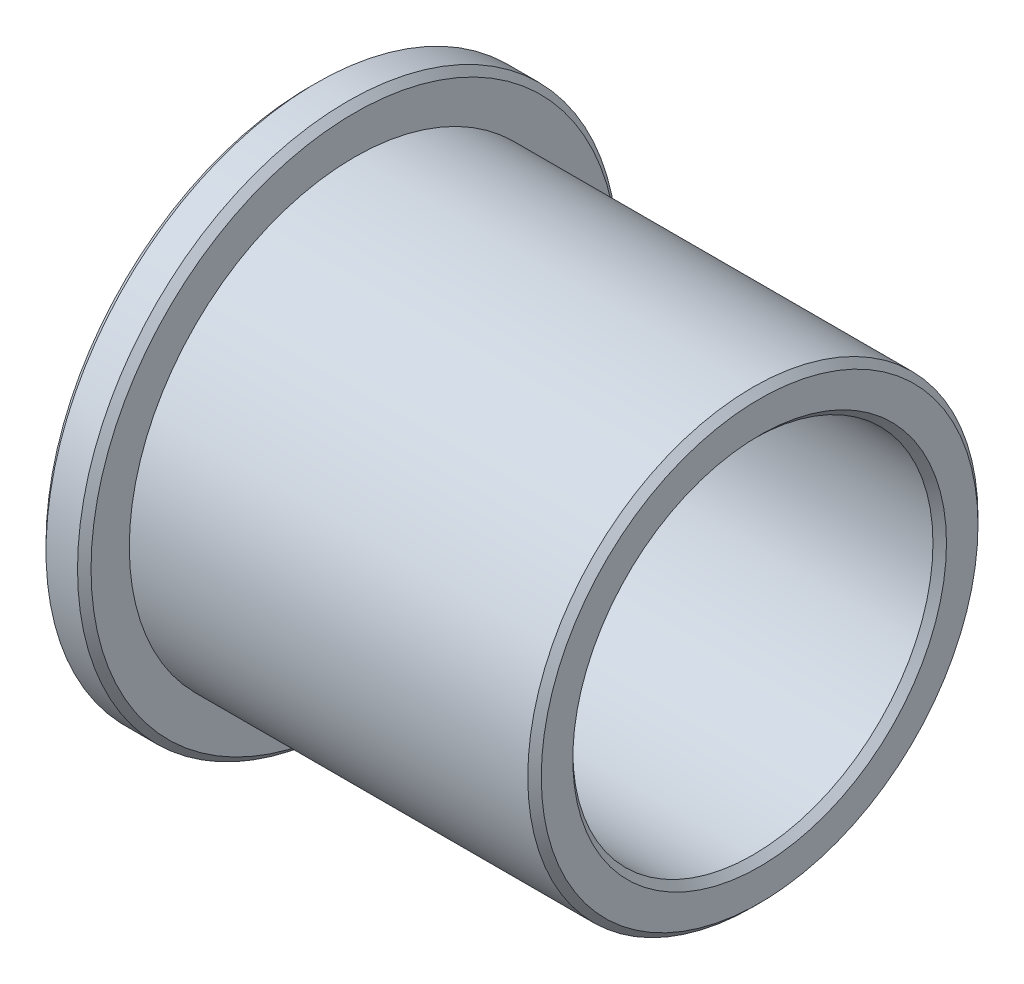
ISO-10303-21;
HEADER;
FILE_DESCRIPTION(('STEP AP214'),'2;1');
FILE_NAME('part.step','',(''),(''),'','','');
FILE_SCHEMA(('AUTOMOTIVE_DESIGN { 1 0 10303 214 1 1 1 1 }'));
ENDSEC;
DATA;
#1=APPLICATION_CONTEXT('core data for automotive mechanical design processes');
#2=APPLICATION_PROTOCOL_DEFINITION('international standard','automotive_design',2000,#1);
#3=PRODUCT_CONTEXT('',#1,'mechanical');
#4=PRODUCT('Part','Part','',(#3));
#5=PRODUCT_RELATED_PRODUCT_CATEGORY('part','',(#4));
#6=PRODUCT_DEFINITION_FORMATION('','',#4);
#7=PRODUCT_DEFINITION_CONTEXT('part definition',#1,'design');
#8=PRODUCT_DEFINITION('design','',#6,#7);
#9=PRODUCT_DEFINITION_SHAPE('','',#8);
#10=(LENGTH_UNIT() NAMED_UNIT(*) SI_UNIT(.MILLI.,.METRE.));
#11=(NAMED_UNIT(*) PLANE_ANGLE_UNIT() SI_UNIT($,.RADIAN.));
#12=(NAMED_UNIT(*) SI_UNIT($,.STERADIAN.) SOLID_ANGLE_UNIT());
#13=UNCERTAINTY_MEASURE_WITH_UNIT(LENGTH_MEASURE(1.E-05),#10,'distance_accuracy_value','');
#14=(GEOMETRIC_REPRESENTATION_CONTEXT(3) GLOBAL_UNCERTAINTY_ASSIGNED_CONTEXT((#13)) GLOBAL_UNIT_ASSIGNED_CONTEXT((#10,
#11,#12)) REPRESENTATION_CONTEXT('',''));
#15=CARTESIAN_POINT('',(0.,0.,0.));
#16=DIRECTION('',(0.,0.,1.));
#17=DIRECTION('',(1.,0.,0.));
#18=AXIS2_PLACEMENT_3D('',#15,#16,#17);
#19=CARTESIAN_POINT('',(-1.34618228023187E-10,0.,0.));
#20=DIRECTION('',(-1.,0.,0.));
#21=DIRECTION('',(0.,0.,1.));
#22=AXIS2_PLACEMENT_3D('',#19,#20,#21);
#23=CONICAL_SURFACE('',#22,8.29999999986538,0.785398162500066);
#24=CARTESIAN_POINT('',(0.3,0.,0.));
#25=DIRECTION('',(1.,0.,0.));
#26=DIRECTION('',(0.,0.,-1.));
#27=AXIS2_PLACEMENT_3D('',#24,#25,#26);
#28=CIRCLE('',#27,7.99999999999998);
#29=CARTESIAN_POINT('',(0.3,0.,-7.99999999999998));
#30=VERTEX_POINT('',#29);
#31=EDGE_CURVE('E45',#30,#30,#28,.T.);
#32=ORIENTED_EDGE('',*,*,#31,.T.);
#33=EDGE_LOOP('',(#32));
#34=FACE_BOUND('',#33,.T.);
#35=CARTESIAN_POINT('',(-1.34617523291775E-10,0.,0.));
#36=DIRECTION('',(-1.,0.,0.));
#37=DIRECTION('',(0.,0.,1.));
#38=AXIS2_PLACEMENT_3D('',#35,#36,#37);
#39=CIRCLE('',#38,8.29999999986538);
#40=CARTESIAN_POINT('',(-1.34617523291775E-10,0.,8.29999999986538));
#41=VERTEX_POINT('',#40);
#42=EDGE_CURVE('E18',#41,#41,#39,.F.);
#43=ORIENTED_EDGE('',*,*,#42,.F.);
#44=EDGE_LOOP('',(#43));
#45=FACE_BOUND('',#44,.T.);
#46=ADVANCED_FACE('F15',(#34,#45),#23,.F.);
#47=CARTESIAN_POINT('',(0.,10.,0.));
#48=DIRECTION('',(-1.,0.,0.));
#49=DIRECTION('',(0.,0.,1.));
#50=AXIS2_PLACEMENT_3D('',#47,#48,#49);
#51=PLANE('',#50);
#52=ORIENTED_EDGE('',*,*,#42,.T.);
#53=EDGE_LOOP('',(#52));
#54=FACE_BOUND('',#53,.T.);
#55=CARTESIAN_POINT('',(-1.34616981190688E-10,0.,0.));
#56=DIRECTION('',(1.,0.,0.));
#57=DIRECTION('',(0.,0.,-1.));
#58=AXIS2_PLACEMENT_3D('',#55,#56,#57);
#59=CIRCLE('',#58,11.7000000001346);
#60=CARTESIAN_POINT('',(-1.34616981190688E-10,0.,-11.7000000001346));
#61=VERTEX_POINT('',#60);
#62=EDGE_CURVE('E42',#61,#61,#59,.T.);
#63=ORIENTED_EDGE('',*,*,#62,.F.);
#64=EDGE_LOOP('',(#63));
#65=FACE_BOUND('',#64,.T.);
#66=ADVANCED_FACE('F144',(#54,#65),#51,.T.);
#67=CARTESIAN_POINT('',(10.,0.,0.));
#68=DIRECTION('',(1.,0.,0.));
#69=DIRECTION('',(0.,0.,-1.));
#70=AXIS2_PLACEMENT_3D('',#67,#68,#69);
#71=CYLINDRICAL_SURFACE('',#70,7.99999999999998);
#72=CARTESIAN_POINT('',(19.6999999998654,0.,0.));
#73=DIRECTION('',(1.,0.,0.));
#74=DIRECTION('',(0.,1.,0.));
#75=AXIS2_PLACEMENT_3D('',#72,#73,#74);
#76=CIRCLE('',#75,8.00000000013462);
#77=CARTESIAN_POINT('',(19.6999999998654,8.00000000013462,0.));
#78=VERTEX_POINT('',#77);
#79=EDGE_CURVE('E44',#78,#78,#76,.T.);
#80=ORIENTED_EDGE('',*,*,#79,.T.);
#81=EDGE_LOOP('',(#80));
#82=FACE_BOUND('',#81,.T.);
#83=ORIENTED_EDGE('',*,*,#31,.F.);
#84=EDGE_LOOP('',(#83));
#85=FACE_BOUND('',#84,.T.);
#86=ADVANCED_FACE('F137',(#82,#85),#71,.F.);
#87=CARTESIAN_POINT('',(0.300000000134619,0.,0.));
#88=DIRECTION('',(1.,0.,0.));
#89=DIRECTION('',(0.,0.,-1.));
#90=AXIS2_PLACEMENT_3D('',#87,#88,#89);
#91=CONICAL_SURFACE('',#90,11.9999999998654,0.7853981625);
#92=ORIENTED_EDGE('',*,*,#62,.T.);
#93=EDGE_LOOP('',(#92));
#94=FACE_BOUND('',#93,.T.);
#95=CARTESIAN_POINT('',(0.3,0.,0.));
#96=DIRECTION('',(1.,0.,0.));
#97=DIRECTION('',(0.,0.,-1.));
#98=AXIS2_PLACEMENT_3D('',#95,#96,#97);
#99=CIRCLE('',#98,12.);
#100=CARTESIAN_POINT('',(0.3,0.,-12.));
#101=VERTEX_POINT('',#100);
#102=EDGE_CURVE('E41',#101,#101,#99,.T.);
#103=ORIENTED_EDGE('',*,*,#102,.F.);
#104=EDGE_LOOP('',(#103));
#105=FACE_BOUND('',#104,.T.);
#106=ADVANCED_FACE('F84',(#94,#105),#91,.T.);
#107=CARTESIAN_POINT('',(20.0000000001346,0.,0.));
#108=DIRECTION('',(1.,0.,0.));
#109=DIRECTION('',(0.,0.,-1.));
#110=AXIS2_PLACEMENT_3D('',#107,#108,#109);
#111=CONICAL_SURFACE('',#110,8.29999999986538,0.785398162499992);
#112=CARTESIAN_POINT('',(20.0000000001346,0.,0.));
#113=DIRECTION('',(1.,0.,0.));
#114=DIRECTION('',(0.,0.,-1.));
#115=AXIS2_PLACEMENT_3D('',#112,#113,#114);
#116=CIRCLE('',#115,8.29999999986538);
#117=CARTESIAN_POINT('',(20.0000000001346,0.,-8.29999999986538));
#118=VERTEX_POINT('',#117);
#119=EDGE_CURVE('E39',#118,#118,#116,.F.);
#120=ORIENTED_EDGE('',*,*,#119,.F.);
#121=EDGE_LOOP('',(#120));
#122=FACE_BOUND('',#121,.T.);
#123=ORIENTED_EDGE('',*,*,#79,.F.);
#124=EDGE_LOOP('',(#123));
#125=FACE_BOUND('',#124,.T.);
#126=ADVANCED_FACE('F74',(#122,#125),#111,.F.);
#127=CARTESIAN_POINT('',(1.,0.,0.));
#128=DIRECTION('',(1.,0.,0.));
#129=DIRECTION('',(0.,0.,-1.));
#130=AXIS2_PLACEMENT_3D('',#127,#128,#129);
#131=CYLINDRICAL_SURFACE('',#130,12.);
#132=ORIENTED_EDGE('',*,*,#102,.T.);
#133=EDGE_LOOP('',(#132));
#134=FACE_BOUND('',#133,.T.);
#135=CARTESIAN_POINT('',(1.69999999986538,0.,0.));
#136=DIRECTION('',(-1.,0.,0.));
#137=DIRECTION('',(0.,1.,0.));
#138=AXIS2_PLACEMENT_3D('',#135,#136,#137);
#139=CIRCLE('',#138,11.9999999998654);
#140=CARTESIAN_POINT('',(1.69999999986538,11.9999999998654,0.));
#141=VERTEX_POINT('',#140);
#142=EDGE_CURVE('E38',#141,#141,#139,.F.);
#143=ORIENTED_EDGE('',*,*,#142,.F.);
#144=EDGE_LOOP('',(#143));
#145=FACE_BOUND('',#144,.T.);
#146=ADVANCED_FACE('F71',(#134,#145),#131,.T.);
#147=CARTESIAN_POINT('',(20.,9.,0.));
#148=DIRECTION('',(1.,0.,0.));
#149=DIRECTION('',(0.,0.,-1.));
#150=AXIS2_PLACEMENT_3D('',#147,#148,#149);
#151=PLANE('',#150);
#152=ORIENTED_EDGE('',*,*,#119,.T.);
#153=EDGE_LOOP('',(#152));
#154=FACE_BOUND('',#153,.T.);
#155=CARTESIAN_POINT('',(20.0000000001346,0.,0.));
#156=DIRECTION('',(-1.,0.,0.));
#157=DIRECTION('',(0.,0.,1.));
#158=AXIS2_PLACEMENT_3D('',#155,#156,#157);
#159=CIRCLE('',#158,9.70000000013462);
#160=CARTESIAN_POINT('',(20.0000000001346,0.,9.70000000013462));
#161=VERTEX_POINT('',#160);
#162=EDGE_CURVE('E35',#161,#161,#159,.T.);
#163=ORIENTED_EDGE('',*,*,#162,.F.);
#164=EDGE_LOOP('',(#163));
#165=FACE_BOUND('',#164,.T.);
#166=ADVANCED_FACE('F73',(#154,#165),#151,.T.);
#167=CARTESIAN_POINT('',(1.69999999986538,0.,0.));
#168=DIRECTION('',(-1.,0.,0.));
#169=DIRECTION('',(0.,0.,1.));
#170=AXIS2_PLACEMENT_3D('',#167,#168,#169);
#171=CONICAL_SURFACE('',#170,11.9999999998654,0.785398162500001);
#172=ORIENTED_EDGE('',*,*,#142,.T.);
#173=EDGE_LOOP('',(#172));
#174=FACE_BOUND('',#173,.T.);
#175=CARTESIAN_POINT('',(2.00000000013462,0.,0.));
#176=DIRECTION('',(-1.,0.,0.));
#177=DIRECTION('',(0.,0.,1.));
#178=AXIS2_PLACEMENT_3D('',#175,#176,#177);
#179=CIRCLE('',#178,11.7000000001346);
#180=CARTESIAN_POINT('',(2.00000000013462,0.,11.7000000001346));
#181=VERTEX_POINT('',#180);
#182=EDGE_CURVE('E27',#181,#181,#179,.F.);
#183=ORIENTED_EDGE('',*,*,#182,.F.);
#184=EDGE_LOOP('',(#183));
#185=FACE_BOUND('',#184,.T.);
#186=ADVANCED_FACE('F68',(#174,#185),#171,.T.);
#187=CARTESIAN_POINT('',(19.6999999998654,0.,0.));
#188=DIRECTION('',(-1.,0.,0.));
#189=DIRECTION('',(0.,0.,1.));
#190=AXIS2_PLACEMENT_3D('',#187,#188,#189);
#191=CONICAL_SURFACE('',#190,9.99999999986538,0.785398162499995);
#192=CARTESIAN_POINT('',(19.7,0.,0.));
#193=DIRECTION('',(1.,0.,0.));
#194=DIRECTION('',(0.,0.,-1.));
#195=AXIS2_PLACEMENT_3D('',#192,#193,#194);
#196=CIRCLE('',#195,10.);
#197=CARTESIAN_POINT('',(19.7,0.,-10.));
#198=VERTEX_POINT('',#197);
#199=EDGE_CURVE('E22',#198,#198,#196,.F.);
#200=ORIENTED_EDGE('',*,*,#199,.F.);
#201=EDGE_LOOP('',(#200));
#202=FACE_BOUND('',#201,.T.);
#203=ORIENTED_EDGE('',*,*,#162,.T.);
#204=EDGE_LOOP('',(#203));
#205=FACE_BOUND('',#204,.T.);
#206=ADVANCED_FACE('F94',(#202,#205),#191,.T.);
#207=CARTESIAN_POINT('',(2.,10.85,0.));
#208=DIRECTION('',(1.,0.,0.));
#209=DIRECTION('',(0.,0.,-1.));
#210=AXIS2_PLACEMENT_3D('',#207,#208,#209);
#211=PLANE('',#210);
#212=CARTESIAN_POINT('',(2.,0.,0.));
#213=DIRECTION('',(1.,0.,0.));
#214=DIRECTION('',(0.,0.,-1.));
#215=AXIS2_PLACEMENT_3D('',#212,#213,#214);
#216=CIRCLE('',#215,10.);
#217=CARTESIAN_POINT('',(2.,0.,-10.));
#218=VERTEX_POINT('',#217);
#219=EDGE_CURVE('E10',#218,#218,#216,.T.);
#220=ORIENTED_EDGE('',*,*,#219,.F.);
#221=EDGE_LOOP('',(#220));
#222=FACE_BOUND('',#221,.T.);
#223=ORIENTED_EDGE('',*,*,#182,.T.);
#224=EDGE_LOOP('',(#223));
#225=FACE_BOUND('',#224,.T.);
#226=ADVANCED_FACE('F89',(#222,#225),#211,.T.);
#227=CARTESIAN_POINT('',(10.85,0.,0.));
#228=DIRECTION('',(1.,0.,0.));
#229=DIRECTION('',(0.,0.,-1.));
#230=AXIS2_PLACEMENT_3D('',#227,#228,#229);
#231=CYLINDRICAL_SURFACE('',#230,10.);
#232=ORIENTED_EDGE('',*,*,#219,.T.);
#233=EDGE_LOOP('',(#232));
#234=FACE_BOUND('',#233,.T.);
#235=ORIENTED_EDGE('',*,*,#199,.T.);
#236=EDGE_LOOP('',(#235));
#237=FACE_BOUND('',#236,.T.);
#238=ADVANCED_FACE('F87',(#234,#237),#231,.T.);
#239=CLOSED_SHELL('',(#46,#66,#86,#106,#126,#146,#166,#186,#206,#226,#238));
#240=MANIFOLD_SOLID_BREP('B1',#239);
#241=ADVANCED_BREP_SHAPE_REPRESENTATION('',(#18,#240),#14);
#242=SHAPE_DEFINITION_REPRESENTATION(#9,#241);
ENDSEC;
END-ISO-10303-21;
